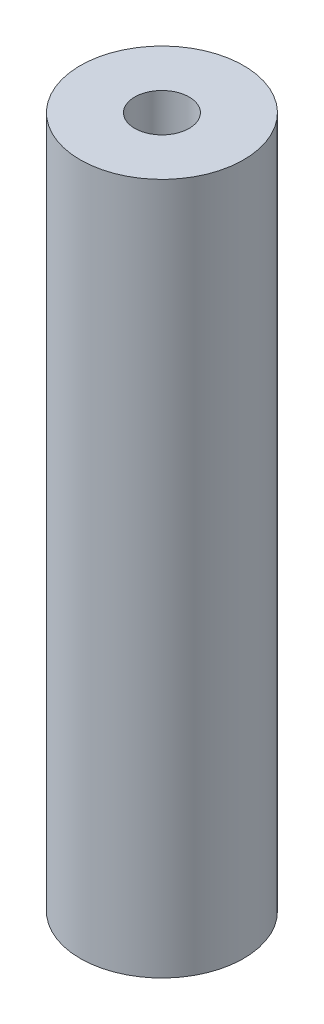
ISO-10303-21;
HEADER;
FILE_DESCRIPTION(('STEP AP214'),'2;1');
FILE_NAME('part.step','',(''),(''),'','','');
FILE_SCHEMA(('AUTOMOTIVE_DESIGN { 1 0 10303 214 1 1 1 1 }'));
ENDSEC;
DATA;
#1=APPLICATION_CONTEXT('core data for automotive mechanical design processes');
#2=APPLICATION_PROTOCOL_DEFINITION('international standard','automotive_design',2000,#1);
#3=PRODUCT_CONTEXT('',#1,'mechanical');
#4=PRODUCT('Part','Part','',(#3));
#5=PRODUCT_RELATED_PRODUCT_CATEGORY('part','',(#4));
#6=PRODUCT_DEFINITION_FORMATION('','',#4);
#7=PRODUCT_DEFINITION_CONTEXT('part definition',#1,'design');
#8=PRODUCT_DEFINITION('design','',#6,#7);
#9=PRODUCT_DEFINITION_SHAPE('','',#8);
#10=(LENGTH_UNIT() NAMED_UNIT(*) SI_UNIT(.MILLI.,.METRE.));
#11=(NAMED_UNIT(*) PLANE_ANGLE_UNIT() SI_UNIT($,.RADIAN.));
#12=(NAMED_UNIT(*) SI_UNIT($,.STERADIAN.) SOLID_ANGLE_UNIT());
#13=UNCERTAINTY_MEASURE_WITH_UNIT(LENGTH_MEASURE(1.E-05),#10,'distance_accuracy_value','');
#14=(GEOMETRIC_REPRESENTATION_CONTEXT(3) GLOBAL_UNCERTAINTY_ASSIGNED_CONTEXT((#13)) GLOBAL_UNIT_ASSIGNED_CONTEXT((#10,
#11,#12)) REPRESENTATION_CONTEXT('',''));
#15=CARTESIAN_POINT('',(0.,0.,0.));
#16=DIRECTION('',(0.,0.,1.));
#17=DIRECTION('',(1.,0.,0.));
#18=AXIS2_PLACEMENT_3D('',#15,#16,#17);
#19=CARTESIAN_POINT('',(0.,127.,0.));
#20=DIRECTION('',(0.,1.,0.));
#21=DIRECTION('',(0.,0.,1.));
#22=AXIS2_PLACEMENT_3D('',#19,#20,#21);
#23=PLANE('',#22);
#24=CARTESIAN_POINT('',(0.,127.,0.));
#25=DIRECTION('',(0.,1.,0.));
#26=DIRECTION('',(0.,0.,1.));
#27=AXIS2_PLACEMENT_3D('',#24,#25,#26);
#28=CIRCLE('',#27,15.);
#29=CARTESIAN_POINT('',(0.,127.,15.));
#30=VERTEX_POINT('',#29);
#31=EDGE_CURVE('E10',#30,#30,#28,.T.);
#32=ORIENTED_EDGE('',*,*,#31,.T.);
#33=EDGE_LOOP('',(#32));
#34=FACE_BOUND('',#33,.T.);
#35=CARTESIAN_POINT('',(0.,127.,0.));
#36=DIRECTION('',(0.,1.,0.));
#37=DIRECTION('',(0.,0.,1.));
#38=AXIS2_PLACEMENT_3D('',#35,#36,#37);
#39=CIRCLE('',#38,5.);
#40=CARTESIAN_POINT('',(0.,127.,5.));
#41=VERTEX_POINT('',#40);
#42=EDGE_CURVE('E44',#41,#41,#39,.T.);
#43=ORIENTED_EDGE('',*,*,#42,.F.);
#44=EDGE_LOOP('',(#43));
#45=FACE_BOUND('',#44,.T.);
#46=ADVANCED_FACE('F33',(#34,#45),#23,.T.);
#47=CARTESIAN_POINT('',(0.,0.,0.));
#48=DIRECTION('',(0.,1.,0.));
#49=DIRECTION('',(0.,0.,1.));
#50=AXIS2_PLACEMENT_3D('',#47,#48,#49);
#51=PLANE('',#50);
#52=CARTESIAN_POINT('',(0.,0.,0.));
#53=DIRECTION('',(0.,1.,0.));
#54=DIRECTION('',(0.,0.,1.));
#55=AXIS2_PLACEMENT_3D('',#52,#53,#54);
#56=CIRCLE('',#55,15.);
#57=CARTESIAN_POINT('',(0.,0.,15.));
#58=VERTEX_POINT('',#57);
#59=EDGE_CURVE('E37',#58,#58,#56,.T.);
#60=ORIENTED_EDGE('',*,*,#59,.F.);
#61=EDGE_LOOP('',(#60));
#62=FACE_BOUND('',#61,.T.);
#63=CARTESIAN_POINT('',(0.,0.,0.));
#64=DIRECTION('',(0.,1.,0.));
#65=DIRECTION('',(0.,0.,1.));
#66=AXIS2_PLACEMENT_3D('',#63,#64,#65);
#67=CIRCLE('',#66,5.);
#68=CARTESIAN_POINT('',(0.,0.,5.));
#69=VERTEX_POINT('',#68);
#70=EDGE_CURVE('E46',#69,#69,#67,.T.);
#71=ORIENTED_EDGE('',*,*,#70,.T.);
#72=EDGE_LOOP('',(#71));
#73=FACE_BOUND('',#72,.T.);
#74=ADVANCED_FACE('F56',(#62,#73),#51,.F.);
#75=CARTESIAN_POINT('',(0.,127.,0.));
#76=DIRECTION('',(0.,-1.,0.));
#77=DIRECTION('',(0.,0.,-1.));
#78=AXIS2_PLACEMENT_3D('',#75,#76,#77);
#79=CYLINDRICAL_SURFACE('',#78,15.);
#80=ORIENTED_EDGE('',*,*,#31,.F.);
#81=EDGE_LOOP('',(#80));
#82=FACE_BOUND('',#81,.T.);
#83=ORIENTED_EDGE('',*,*,#59,.T.);
#84=EDGE_LOOP('',(#83));
#85=FACE_BOUND('',#84,.T.);
#86=ADVANCED_FACE('F35',(#82,#85),#79,.T.);
#87=CARTESIAN_POINT('',(0.,127.,0.));
#88=DIRECTION('',(0.,-1.,0.));
#89=DIRECTION('',(0.,0.,-1.));
#90=AXIS2_PLACEMENT_3D('',#87,#88,#89);
#91=CYLINDRICAL_SURFACE('',#90,5.);
#92=ORIENTED_EDGE('',*,*,#42,.T.);
#93=EDGE_LOOP('',(#92));
#94=FACE_BOUND('',#93,.T.);
#95=ORIENTED_EDGE('',*,*,#70,.F.);
#96=EDGE_LOOP('',(#95));
#97=FACE_BOUND('',#96,.T.);
#98=ADVANCED_FACE('F52',(#94,#97),#91,.F.);
#99=CLOSED_SHELL('',(#46,#74,#86,#98));
#100=MANIFOLD_SOLID_BREP('B2',#99);
#101=ADVANCED_BREP_SHAPE_REPRESENTATION('',(#18,#100),#14);
#102=SHAPE_DEFINITION_REPRESENTATION(#9,#101);
ENDSEC;
END-ISO-10303-21;
